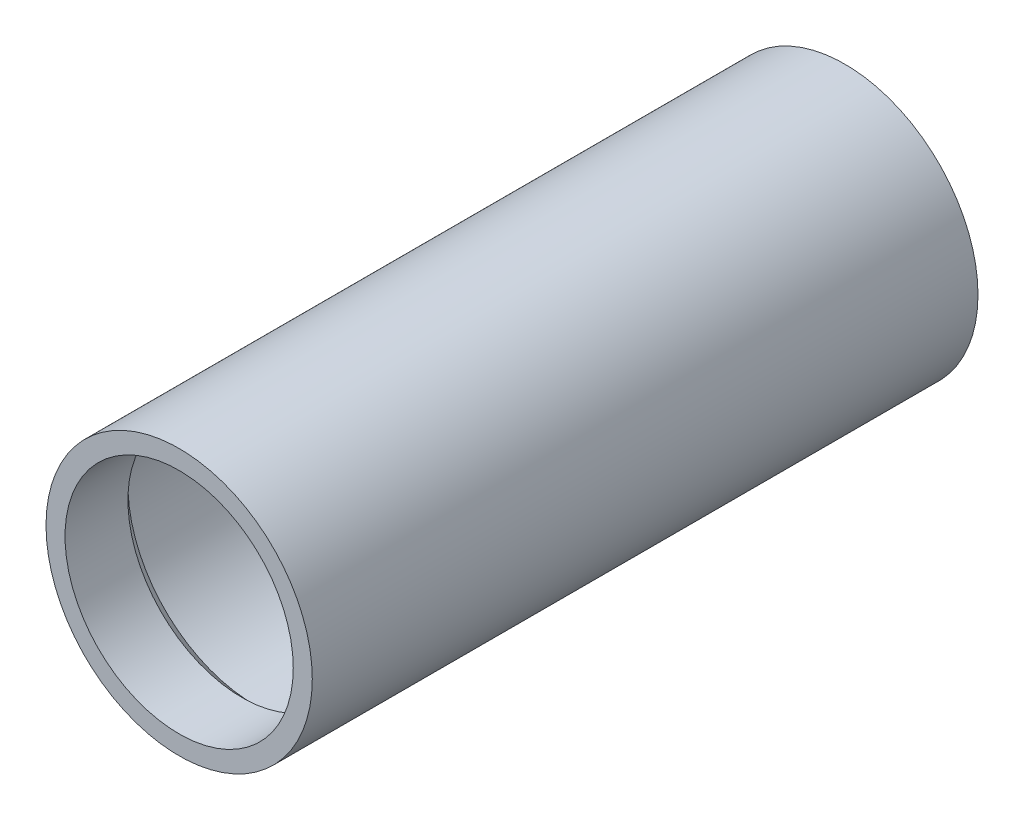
from build123d import *


with BuildPart() as part:
    # Sketch1 → Revolve1 (revolve)
    with BuildSketch(Plane(origin=(0, 0, 0), x_dir=(0, 0, -1), z_dir=(1, 0, 0)), mode=Mode.PRIVATE) as revolve1_sk:
        Polygon((0, 44.45), (222.25, 44.45), (222.25, 38.1), (201.25, 38.1), (196.9, 42.45), (25.35, 42.45), (21, 38.1), (0, 38.1), align=None)
    revolve(revolve1_sk.sketch.rotate(Axis((0, 0, 0), (0, 0, -1)), 90), axis=Axis((0, 0, 0), (0, 0, -1)))


solid = part.part
